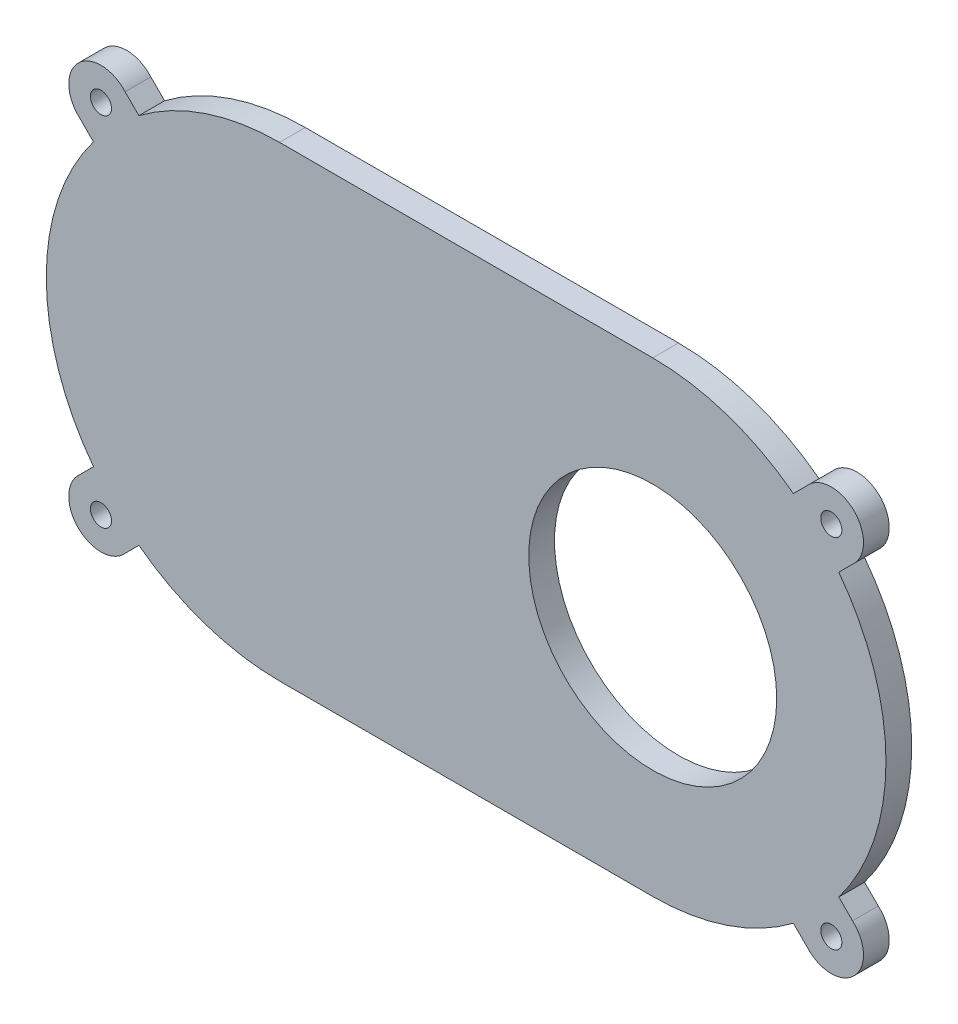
from build123d import *

# Parameters (mm, degrees)
SKETCH1_R           = 2.0828
SKETCH1_R_2         = 24.4729
BOSS_EXTRUDE1_DEPTH = 5.08


with BuildPart() as part:
    # Sketch1 → Boss-Extrude1 (new body)
    with BuildSketch(Plane.XY):
        with BuildLine():
            Line((-10.449327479, -17.704517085), (-13.167291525, -20.422481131))
            ThreePointArc((-13.167291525, -20.422481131), (-13.462404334, -29.679615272), (-4.205270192, -29.384502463))
            Line((-4.205270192, -29.384502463), (-1.487306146, -26.666538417))
            ThreePointArc((-1.487306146, -26.666538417), (11.633770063, -33.589193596), (26.275228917, -35.979481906))
            Line((26.275228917, -35.979481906), (99.935228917, -35.979481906))
            ThreePointArc((99.935228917, -35.979481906), (114.57668777, -33.589193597), (127.697763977, -26.66653842))
            Line((127.697763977, -26.66653842), (130.415728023, -29.384502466))
            ThreePointArc((130.415728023, -29.384502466), (139.672862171, -29.679615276), (139.377749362, -20.422481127))
            Line((139.377749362, -20.422481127), (136.659785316, -17.704517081))
            ThreePointArc((136.659785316, -17.704517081), (145.972728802, 10.058017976), (136.659785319, 37.820553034))
            Line((136.659785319, 37.820553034), (139.377749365, 40.53851708))
            ThreePointArc((139.377749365, 40.53851708), (139.672862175, 49.795651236), (130.415728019, 49.500538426))
            Line((130.415728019, 49.500538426), (127.697763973, 46.78257438))
            ThreePointArc((127.697763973, 46.78257438), (114.576687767, 53.705229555), (99.935228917, 56.095517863))
            Line((99.935228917, 56.095517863), (26.275228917, 56.095517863))
            ThreePointArc((26.275228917, 56.095517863), (11.633770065, 53.705229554), (-1.487306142, 46.782574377))
            Line((-1.487306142, 46.782574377), (-4.205270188, 49.500538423))
            ThreePointArc((-4.205270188, 49.500538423), (-13.462404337, 49.795651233), (-13.167291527, 40.538517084))
            Line((-13.167291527, 40.538517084), (-10.449327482, 37.820553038))
            ThreePointArc((-10.449327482, 37.820553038), (-19.762270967, 10.058017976), (-10.449327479, -17.704517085))
        make_face()
        with Locations((-8.972276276, -25.189487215)):
            Circle(SKETCH1_R, mode=Mode.SUBTRACT)
        with Locations((-8.972276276, 45.305523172)):
            Circle(SKETCH1_R, mode=Mode.SUBTRACT)
        with Locations((135.182734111, 45.305523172)):
            Circle(SKETCH1_R, mode=Mode.SUBTRACT)
        with Locations((135.182734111, -25.189487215)):
            Circle(SKETCH1_R, mode=Mode.SUBTRACT)
        with Locations((99.935228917, 10.058017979)):
            Circle(SKETCH1_R_2, mode=Mode.SUBTRACT)
    extrude(amount=BOSS_EXTRUDE1_DEPTH)


solid = part.part
